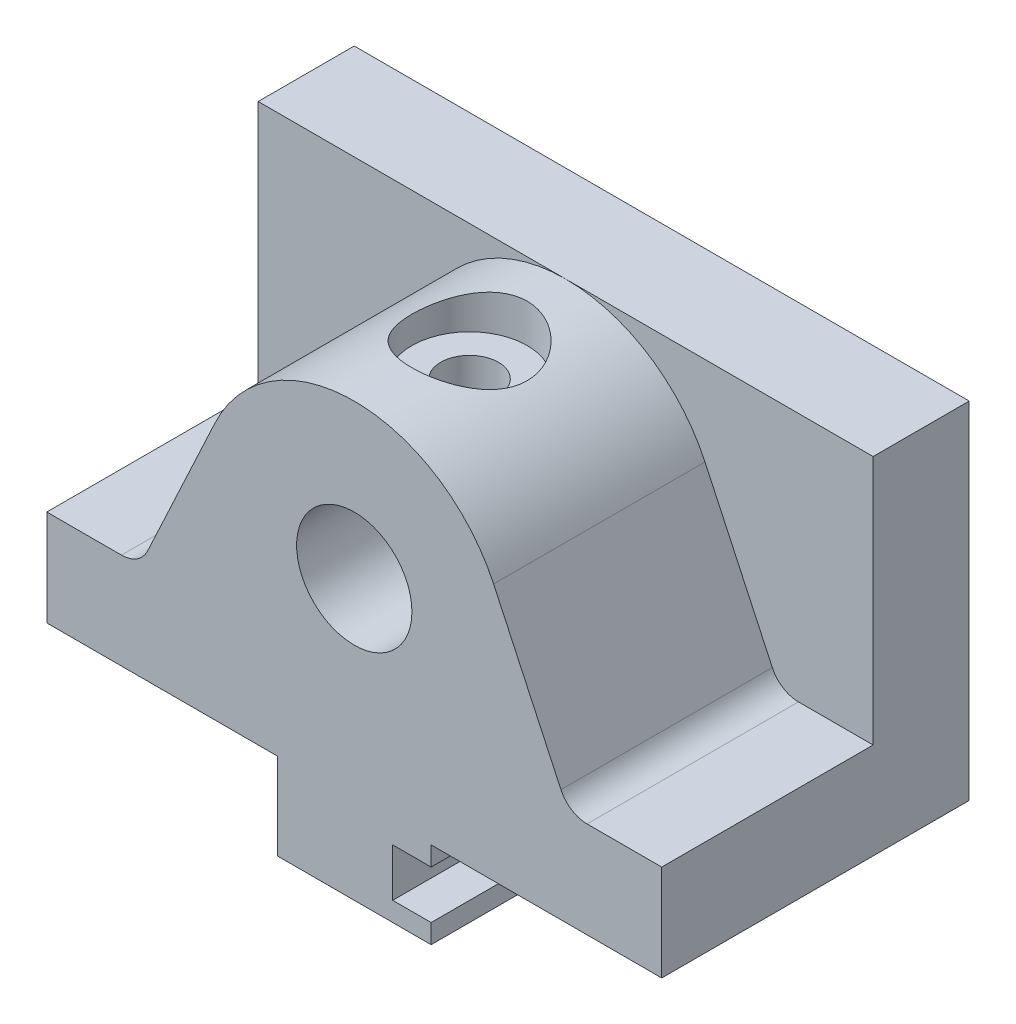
from build123d import *

# Parameters (mm, degrees)
BOSS_EXTRUDE1_DEPTH       = 22
BOSS_EXTRUDE2_DEPTH       = 10
FILLET1_R                 = 3
SKETCH3_R                 = 6
CUT_EXTRUDE1_DEPTH        = 24
M6X1_0_TAPPED_HOLE1_D     = 6
M6X1_0_TAPPED_HOLE1_DEPTH = 17
M6X1_0_TAPPED_HOLE1_TIP   = 1.802581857
HOLE1_D                   = 6
HOLE1_DEPTH               = 15.999
HOLE1_CBORE_D             = 12
HOLE1_CBORE_DEPTH         = 4
HOLE1_TIP                 = 1.802581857
SKETCH13_W                = 4
SKETCH13_H                = 5
CUT_EXTRUDE2_DEPTH        = 58.827329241


with BuildPart() as part:
    # Sketch1 → Boss-Extrude1 (new body)
    with BuildSketch(Plane.XY):
        with BuildLine():
            Line((-32, 0), (-8, 0))
            Line((-8, 0), (-8, -9))
            Line((-8, -9), (8, -9))
            Line((8, -9), (8, 0))
            Line((8, 0), (32, 0))
            Line((32, 0), (32, 10))
            Line((32, 10), (22.317123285, 10))
            Line((22.317123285, 10), (14.500924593, 26.761892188))
            ThreePointArc((14.500924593, 26.761892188), (0, 36), (-14.500924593, 26.761892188))
            Line((-14.500924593, 26.761892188), (-22.317123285, 10))
            Line((-22.317123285, 10), (-32, 10))
            Line((-32, 10), (-32, 0))
        make_face()
    extrude(amount=BOSS_EXTRUDE1_DEPTH)

    # Sketch2 → Boss-Extrude2 (add)
    with BuildSketch(Plane(origin=(0, 0, 0), x_dir=(-1, 0, 0), z_dir=(0, 0, -1))):
        Polygon((-32, 0), (-32, 10), (-32, 36), (32, 36), (32, 10), (32, 0), (8, 0), (8, -9), (-8, -9), (-8, 0), align=None)
    extrude(amount=BOSS_EXTRUDE2_DEPTH)

    # Fillet1
    fillet1_edges = [part.edges().sort_by_distance(p)[0] for p in [
        (-22.317123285, 10, 11),
        (22.317123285, 10, 11),
    ]]
    fillet(fillet1_edges, radius=FILLET1_R)

    # Sketch3 → Cut-Extrude1 (cut)
    with BuildSketch(Plane.XY.offset(22)):
        with Locations((0, 20)):
            Circle(SKETCH3_R)
    extrude(amount=-CUT_EXTRUDE1_DEPTH, mode=Mode.SUBTRACT)

    # M6x1.0 Tapped Hole1
    with Locations(Plane.XZ.offset(9)):
        with Locations((0, 14), (0, -2)):
            Hole(M6X1_0_TAPPED_HOLE1_D / 2, depth=M6X1_0_TAPPED_HOLE1_DEPTH)
            with Locations((0, 0, -(M6X1_0_TAPPED_HOLE1_DEPTH + M6X1_0_TAPPED_HOLE1_TIP / 2))):  # 118° drill point
                Cone(0, M6X1_0_TAPPED_HOLE1_D / 2, M6X1_0_TAPPED_HOLE1_TIP, mode=Mode.SUBTRACT)

    # Hole1
    with Locations(Plane(origin=(0, 36, 0), x_dir=(-1, 0, 0), z_dir=(0, 1, 0))):
        with Locations((0, 10)):
            CounterBoreHole(HOLE1_D / 2, HOLE1_CBORE_D / 2, HOLE1_CBORE_DEPTH, depth=HOLE1_DEPTH)
            with Locations((0, 0, -(HOLE1_DEPTH + HOLE1_TIP / 2))):  # 118° drill point
                Cone(0, HOLE1_D / 2, HOLE1_TIP, mode=Mode.SUBTRACT)

    # Sketch13 → Cut-Extrude2 (cut, through all)
    with BuildSketch(Plane.XY.offset(22)):
        with Locations((6, -4.5)):
            Rectangle(SKETCH13_W, SKETCH13_H)
    extrude(amount=-CUT_EXTRUDE2_DEPTH, mode=Mode.SUBTRACT)


solid = part.part
